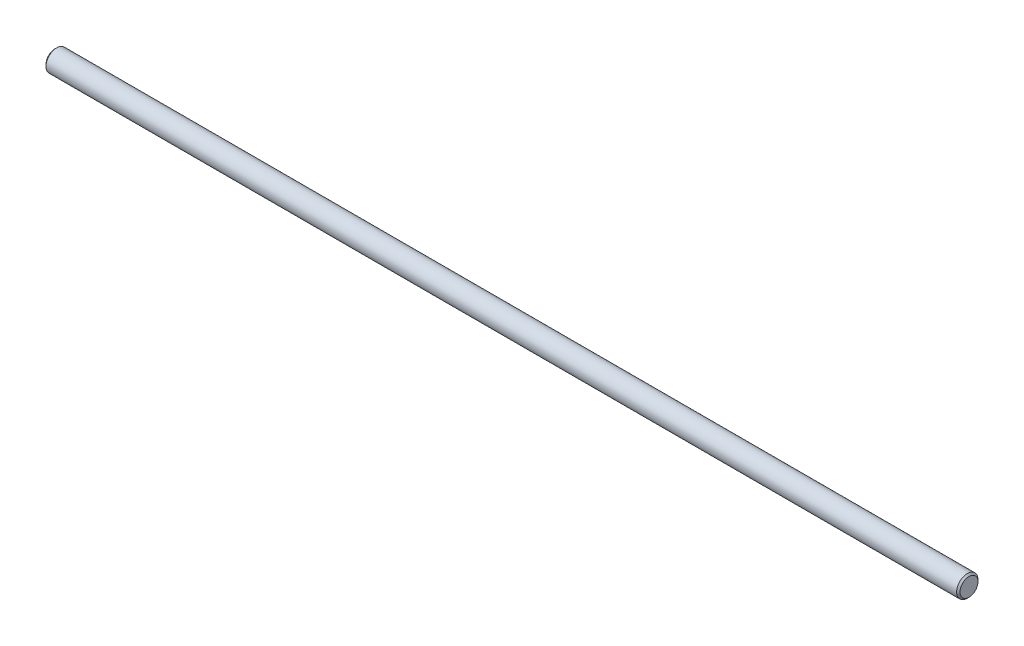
ISO-10303-21;
HEADER;
FILE_DESCRIPTION(('STEP AP214'),'2;1');
FILE_NAME('part.step','',(''),(''),'','','');
FILE_SCHEMA(('AUTOMOTIVE_DESIGN { 1 0 10303 214 1 1 1 1 }'));
ENDSEC;
DATA;
#1=APPLICATION_CONTEXT('core data for automotive mechanical design processes');
#2=APPLICATION_PROTOCOL_DEFINITION('international standard','automotive_design',2000,#1);
#3=PRODUCT_CONTEXT('',#1,'mechanical');
#4=PRODUCT('Part','Part','',(#3));
#5=PRODUCT_RELATED_PRODUCT_CATEGORY('part','',(#4));
#6=PRODUCT_DEFINITION_FORMATION('','',#4);
#7=PRODUCT_DEFINITION_CONTEXT('part definition',#1,'design');
#8=PRODUCT_DEFINITION('design','',#6,#7);
#9=PRODUCT_DEFINITION_SHAPE('','',#8);
#10=(LENGTH_UNIT() NAMED_UNIT(*) SI_UNIT(.MILLI.,.METRE.));
#11=(NAMED_UNIT(*) PLANE_ANGLE_UNIT() SI_UNIT($,.RADIAN.));
#12=(NAMED_UNIT(*) SI_UNIT($,.STERADIAN.) SOLID_ANGLE_UNIT());
#13=UNCERTAINTY_MEASURE_WITH_UNIT(LENGTH_MEASURE(1.E-05),#10,'distance_accuracy_value','');
#14=(GEOMETRIC_REPRESENTATION_CONTEXT(3) GLOBAL_UNCERTAINTY_ASSIGNED_CONTEXT((#13)) GLOBAL_UNIT_ASSIGNED_CONTEXT((#10,
#11,#12)) REPRESENTATION_CONTEXT('',''));
#15=CARTESIAN_POINT('',(0.,0.,0.));
#16=DIRECTION('',(0.,0.,1.));
#17=DIRECTION('',(1.,0.,0.));
#18=AXIS2_PLACEMENT_3D('',#15,#16,#17);
#19=CARTESIAN_POINT('',(203.2,0.,0.));
#20=DIRECTION('',(-1.,0.,0.));
#21=DIRECTION('',(0.,0.,1.));
#22=AXIS2_PLACEMENT_3D('',#19,#20,#21);
#23=CYLINDRICAL_SURFACE('',#22,2.38125);
#24=CARTESIAN_POINT('',(202.819,0.,0.));
#25=DIRECTION('',(1.,0.,0.));
#26=DIRECTION('',(0.,0.,-1.));
#27=AXIS2_PLACEMENT_3D('',#24,#25,#26);
#28=CIRCLE('',#27,2.38125);
#29=CARTESIAN_POINT('',(202.819,0.,-2.38125));
#30=VERTEX_POINT('',#29);
#31=EDGE_CURVE('E30',#30,#30,#28,.F.);
#32=ORIENTED_EDGE('',*,*,#31,.T.);
#33=EDGE_LOOP('',(#32));
#34=FACE_BOUND('',#33,.T.);
#35=CARTESIAN_POINT('',(0.380999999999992,0.,0.));
#36=DIRECTION('',(1.,0.,0.));
#37=DIRECTION('',(0.,0.,-1.));
#38=AXIS2_PLACEMENT_3D('',#35,#36,#37);
#39=CIRCLE('',#38,2.38125);
#40=CARTESIAN_POINT('',(0.380999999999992,0.,-2.38125));
#41=VERTEX_POINT('',#40);
#42=EDGE_CURVE('E34',#41,#41,#39,.T.);
#43=ORIENTED_EDGE('',*,*,#42,.T.);
#44=EDGE_LOOP('',(#43));
#45=FACE_BOUND('',#44,.T.);
#46=ADVANCED_FACE('F24',(#34,#45),#23,.T.);
#47=CARTESIAN_POINT('',(203.2,0.,0.));
#48=DIRECTION('',(1.,0.,0.));
#49=DIRECTION('',(0.,0.,-1.));
#50=AXIS2_PLACEMENT_3D('',#47,#48,#49);
#51=PLANE('',#50);
#52=CARTESIAN_POINT('',(203.2,0.,0.));
#53=DIRECTION('',(1.,0.,0.));
#54=DIRECTION('',(0.,0.,-1.));
#55=AXIS2_PLACEMENT_3D('',#52,#53,#54);
#56=CIRCLE('',#55,2.00025000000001);
#57=CARTESIAN_POINT('',(203.2,0.,-2.00025000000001));
#58=VERTEX_POINT('',#57);
#59=EDGE_CURVE('E38',#58,#58,#56,.T.);
#60=ORIENTED_EDGE('',*,*,#59,.T.);
#61=EDGE_LOOP('',(#60));
#62=FACE_BOUND('',#61,.T.);
#63=ADVANCED_FACE('F44',(#62),#51,.T.);
#64=CARTESIAN_POINT('',(0.,0.,0.));
#65=DIRECTION('',(1.,0.,0.));
#66=DIRECTION('',(0.,0.,-1.));
#67=AXIS2_PLACEMENT_3D('',#64,#65,#66);
#68=PLANE('',#67);
#69=CARTESIAN_POINT('',(0.,0.,0.));
#70=DIRECTION('',(1.,0.,0.));
#71=DIRECTION('',(0.,0.,-1.));
#72=AXIS2_PLACEMENT_3D('',#69,#70,#71);
#73=CIRCLE('',#72,2.00025000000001);
#74=CARTESIAN_POINT('',(0.,0.,-2.00025000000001));
#75=VERTEX_POINT('',#74);
#76=EDGE_CURVE('E10',#75,#75,#73,.F.);
#77=ORIENTED_EDGE('',*,*,#76,.T.);
#78=EDGE_LOOP('',(#77));
#79=FACE_BOUND('',#78,.T.);
#80=ADVANCED_FACE('F49',(#79),#68,.F.);
#81=CARTESIAN_POINT('',(203.2,0.,0.));
#82=DIRECTION('',(-1.,0.,0.));
#83=DIRECTION('',(0.,0.,1.));
#84=AXIS2_PLACEMENT_3D('',#81,#82,#83);
#85=CONICAL_SURFACE('',#84,2.00025000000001,0.785398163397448);
#86=ORIENTED_EDGE('',*,*,#31,.F.);
#87=EDGE_LOOP('',(#86));
#88=FACE_BOUND('',#87,.T.);
#89=ORIENTED_EDGE('',*,*,#59,.F.);
#90=EDGE_LOOP('',(#89));
#91=FACE_BOUND('',#90,.T.);
#92=ADVANCED_FACE('F46',(#88,#91),#85,.T.);
#93=CARTESIAN_POINT('',(0.380999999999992,0.,0.));
#94=DIRECTION('',(1.,0.,0.));
#95=DIRECTION('',(0.,0.,-1.));
#96=AXIS2_PLACEMENT_3D('',#93,#94,#95);
#97=CONICAL_SURFACE('',#96,2.38125,0.785398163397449);
#98=ORIENTED_EDGE('',*,*,#76,.F.);
#99=EDGE_LOOP('',(#98));
#100=FACE_BOUND('',#99,.T.);
#101=ORIENTED_EDGE('',*,*,#42,.F.);
#102=EDGE_LOOP('',(#101));
#103=FACE_BOUND('',#102,.T.);
#104=ADVANCED_FACE('F48',(#100,#103),#97,.T.);
#105=CLOSED_SHELL('',(#46,#63,#80,#92,#104));
#106=MANIFOLD_SOLID_BREP('B2',#105);
#107=ADVANCED_BREP_SHAPE_REPRESENTATION('',(#18,#106),#14);
#108=SHAPE_DEFINITION_REPRESENTATION(#9,#107);
ENDSEC;
END-ISO-10303-21;
